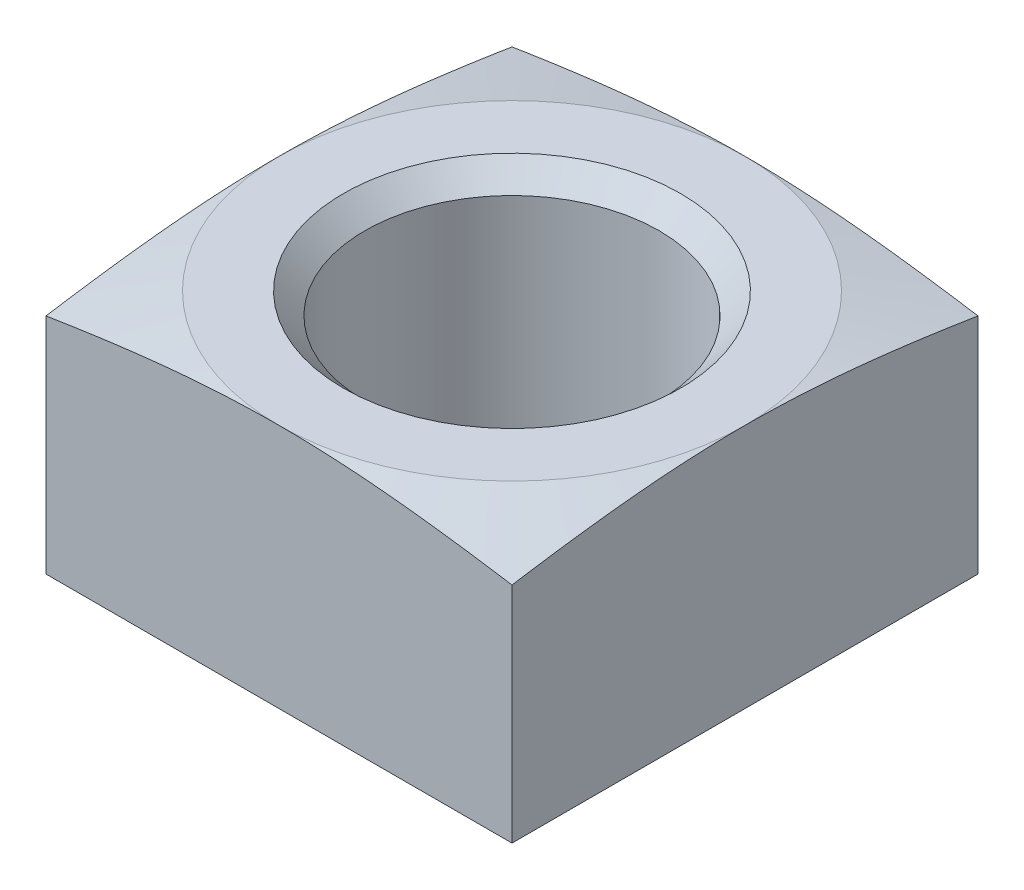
from build123d import *

# Parameters (mm, degrees)
SKETCH8_W           = 19
SKETCH8_H           = 10
BOSS_EXTRUDE2_DEPTH = 9.5
SKETCH11_R          = 6
CUT_EXTRUDE1_DEPTH  = 10
CHAMFER1_SIZE       = 0.875


with BuildPart() as part:
    # Sketch8 → Boss-Extrude2 (new, symmetric)
    with BuildSketch(Plane(origin=(0, 0, 0), x_dir=(0, 0, -1), z_dir=(1, 0, 0))):
        Rectangle(SKETCH8_W, SKETCH8_H)
    extrude(amount=BOSS_EXTRUDE2_DEPTH, both=True)

    # Sketch10 → Cut-Revolve1 (revolve, cut)
    with BuildSketch(Plane(origin=(0, 0, 0), x_dir=(0, 0, -1), z_dir=(1, 0, 0))):
        Polygon((-9.5, 5), (-13.5, 5), (-13.5, 4.1), align=None)
    revolve(axis=Axis((0, 59.838437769, 0), (0, -1, 0)), mode=Mode.SUBTRACT)

    # Sketch11 → Cut-Extrude1 (cut)
    with BuildSketch(Plane(origin=(0, 5, 0), x_dir=(1, 0, 0), z_dir=(0, 1, 0))):
        with Locations(Location((0, 0, 0), (0, 0, 270))):
            Circle(SKETCH11_R)
    extrude(amount=-CUT_EXTRUDE1_DEPTH, mode=Mode.SUBTRACT)

    # Chamfer1
    chamfer1_edges = [part.edges().sort_by_distance(p)[0] for p in [
        (0, 5, -6),
        (0, -5, -6),
    ]]
    chamfer(chamfer1_edges, length=CHAMFER1_SIZE)


solid = part.part
